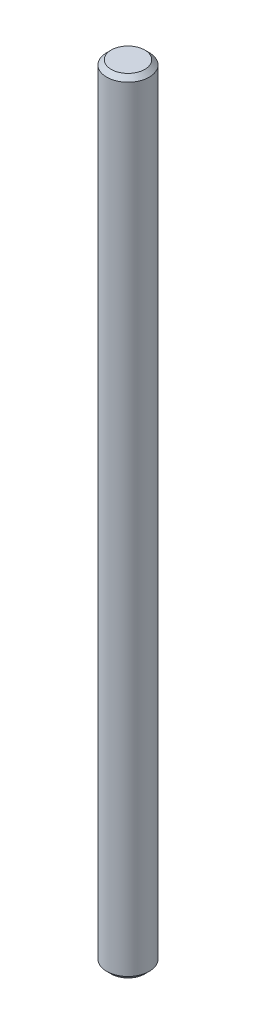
from build123d import *

# Parameters (mm, degrees)
SKETCH_1_R      = 0.95
EXTRUDE_1_DEPTH = 35
CHAMFER_1_SIZE  = 0.2


with BuildPart() as part:
    # Sketch 1 → Extrude 1 (new body)
    with BuildSketch(Plane(origin=(0, 0, 0), x_dir=(1, 0, 0), z_dir=(0, 1, 0))):
        with Locations(Location((0, 0, 0), (0, 0, 270))):
            Circle(SKETCH_1_R)
    extrude(amount=EXTRUDE_1_DEPTH)

    # Chamfer 1
    chamfer_1_edges = [part.edges().sort_by_distance(p)[0] for p in [
        (0, 0, -0.95),
        (0, 35, -0.95),
    ]]
    chamfer(chamfer_1_edges, length=CHAMFER_1_SIZE)


solid = part.part
